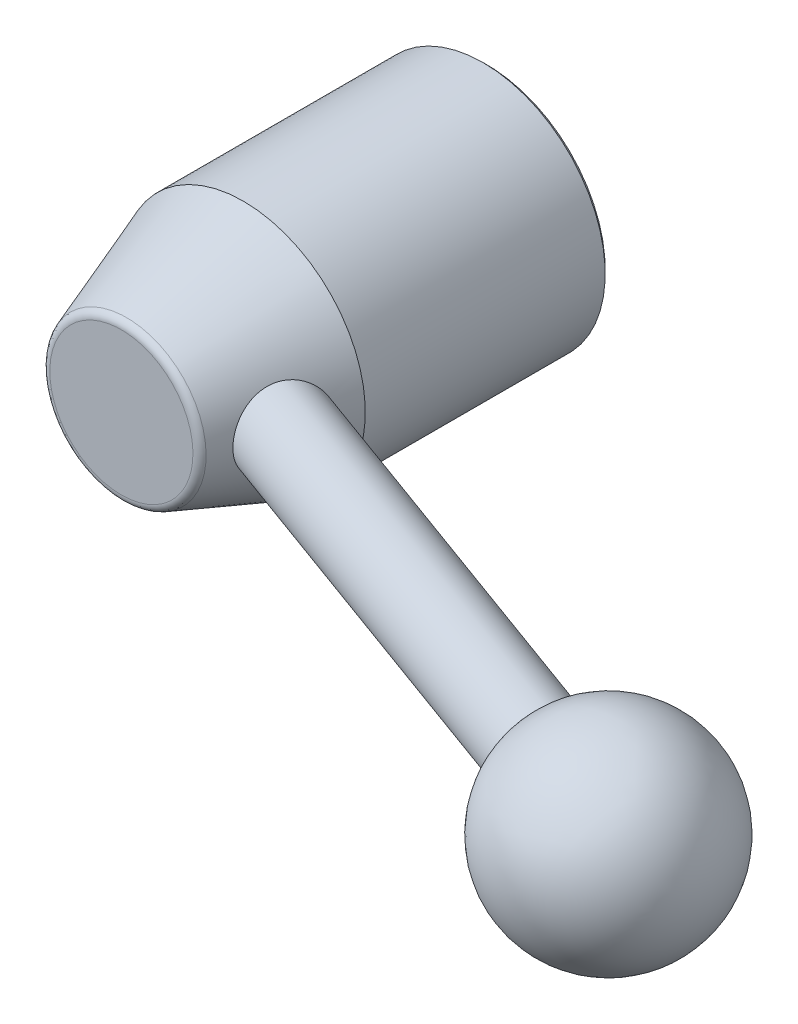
ISO-10303-21;
HEADER;
FILE_DESCRIPTION(('STEP AP214'),'2;1');
FILE_NAME('part.step','',(''),(''),'','','');
FILE_SCHEMA(('AUTOMOTIVE_DESIGN { 1 0 10303 214 1 1 1 1 }'));
ENDSEC;
DATA;
#1=APPLICATION_CONTEXT('core data for automotive mechanical design processes');
#2=APPLICATION_PROTOCOL_DEFINITION('international standard','automotive_design',2000,#1);
#3=PRODUCT_CONTEXT('',#1,'mechanical');
#4=PRODUCT('Part','Part','',(#3));
#5=PRODUCT_RELATED_PRODUCT_CATEGORY('part','',(#4));
#6=PRODUCT_DEFINITION_FORMATION('','',#4);
#7=PRODUCT_DEFINITION_CONTEXT('part definition',#1,'design');
#8=PRODUCT_DEFINITION('design','',#6,#7);
#9=PRODUCT_DEFINITION_SHAPE('','',#8);
#10=(LENGTH_UNIT() NAMED_UNIT(*) SI_UNIT(.MILLI.,.METRE.));
#11=(NAMED_UNIT(*) PLANE_ANGLE_UNIT() SI_UNIT($,.RADIAN.));
#12=(NAMED_UNIT(*) SI_UNIT($,.STERADIAN.) SOLID_ANGLE_UNIT());
#13=UNCERTAINTY_MEASURE_WITH_UNIT(LENGTH_MEASURE(1.E-05),#10,'distance_accuracy_value','');
#14=(GEOMETRIC_REPRESENTATION_CONTEXT(3) GLOBAL_UNCERTAINTY_ASSIGNED_CONTEXT((#13)) GLOBAL_UNIT_ASSIGNED_CONTEXT((#10,
#11,#12)) REPRESENTATION_CONTEXT('',''));
#15=CARTESIAN_POINT('',(0.,0.,0.));
#16=DIRECTION('',(0.,0.,1.));
#17=DIRECTION('',(1.,0.,0.));
#18=AXIS2_PLACEMENT_3D('',#15,#16,#17);
#19=CARTESIAN_POINT('',(0.,0.,44.3567262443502));
#20=DIRECTION('',(0.,0.,-1.));
#21=DIRECTION('',(0.,1.,0.));
#22=AXIS2_PLACEMENT_3D('',#19,#20,#21);
#23=CONICAL_SURFACE('',#22,9.77457898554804,0.349065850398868);
#24=CARTESIAN_POINT('',(0.,0.,44.3567262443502));
#25=DIRECTION('',(0.,0.,1.));
#26=DIRECTION('',(0.,-1.,0.));
#27=AXIS2_PLACEMENT_3D('',#24,#25,#26);
#28=CIRCLE('',#27,9.77457898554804);
#29=CARTESIAN_POINT('',(0.,-9.77457898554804,44.3567262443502));
#30=VERTEX_POINT('',#29);
#31=EDGE_CURVE('E38',#30,#30,#28,.T.);
#32=ORIENTED_EDGE('',*,*,#31,.F.);
#33=EDGE_LOOP('',(#32));
#34=FACE_BOUND('',#33,.T.);
#35=CARTESIAN_POINT('',(0.,0.,30.));
#36=DIRECTION('',(0.,0.,1.));
#37=DIRECTION('',(0.,-1.,0.));
#38=AXIS2_PLACEMENT_3D('',#35,#36,#37);
#39=CIRCLE('',#38,15.);
#40=CARTESIAN_POINT('',(0.,-15.,30.));
#41=VERTEX_POINT('',#40);
#42=EDGE_CURVE('E23',#41,#41,#39,.T.);
#43=ORIENTED_EDGE('',*,*,#42,.T.);
#44=EDGE_LOOP('',(#43));
#45=FACE_BOUND('',#44,.T.);
#46=CARTESIAN_POINT('',(13.4866161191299,-2.89578014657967,33.3134656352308));
#47=CARTESIAN_POINT('',(13.3849436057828,-3.12847751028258,33.452375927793));
#48=CARTESIAN_POINT('',(13.2731283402,-3.34645254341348,33.6084157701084));
#49=CARTESIAN_POINT('',(13.0355370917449,-3.74764614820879,33.9517038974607));
#50=CARTESIAN_POINT('',(12.9097604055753,-3.93086296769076,34.1389537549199));
#51=CARTESIAN_POINT('',(12.7160237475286,-4.17595402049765,34.4404563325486));
#52=CARTESIAN_POINT('',(12.6505448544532,-4.25274513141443,34.5444871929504));
#53=CARTESIAN_POINT('',(12.5187958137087,-4.39589711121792,34.7590016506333));
#54=CARTESIAN_POINT('',(12.4525259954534,-4.46226216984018,34.8694826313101));
#55=CARTESIAN_POINT('',(12.3201090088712,-4.58407191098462,35.096426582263));
#56=CARTESIAN_POINT('',(12.2539618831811,-4.63951331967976,35.212891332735));
#57=CARTESIAN_POINT('',(12.1227878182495,-4.73896035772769,35.4511449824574));
#58=CARTESIAN_POINT('',(12.0577603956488,-4.78297104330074,35.572931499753));
#59=CARTESIAN_POINT('',(11.9308448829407,-4.85850573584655,35.8190694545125));
#60=CARTESIAN_POINT('',(11.8689221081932,-4.89023059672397,35.943341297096));
#61=CARTESIAN_POINT('',(11.7479521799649,-4.94189925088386,36.1956151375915));
#62=CARTESIAN_POINT('',(11.6889037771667,-4.96184820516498,36.3236154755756));
#63=CARTESIAN_POINT('',(11.574487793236,-4.98973747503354,36.5825001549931));
#64=CARTESIAN_POINT('',(11.5191192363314,-4.99768098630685,36.713383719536));
#65=CARTESIAN_POINT('',(11.4127699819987,-5.00144266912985,36.9770915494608));
#66=CARTESIAN_POINT('',(11.3617890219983,-4.99726156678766,37.1099156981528));
#67=CARTESIAN_POINT('',(11.2679280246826,-4.97745127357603,37.3678410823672));
#68=CARTESIAN_POINT('',(11.2247376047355,-4.96257761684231,37.4928880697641));
#69=CARTESIAN_POINT('',(11.1430364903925,-4.92235520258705,37.7428747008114));
#70=CARTESIAN_POINT('',(11.1045273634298,-4.89700294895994,37.867814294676));
#71=CARTESIAN_POINT('',(11.0324205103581,-4.83607173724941,38.1165503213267));
#72=CARTESIAN_POINT('',(10.998820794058,-4.80049694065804,38.2403471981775));
#73=CARTESIAN_POINT('',(10.9365481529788,-4.71943295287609,38.485966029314));
#74=CARTESIAN_POINT('',(10.9078771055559,-4.67393999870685,38.6077872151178));
#75=CARTESIAN_POINT('',(10.8557317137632,-4.57412114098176,38.8468964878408));
#76=CARTESIAN_POINT('',(10.8321926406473,-4.51992231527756,38.9642235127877));
#77=CARTESIAN_POINT('',(10.7896018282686,-4.40270182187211,39.1952445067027));
#78=CARTESIAN_POINT('',(10.7705517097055,-4.33967698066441,39.3089371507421));
#79=CARTESIAN_POINT('',(10.7196912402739,-4.13803226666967,39.6433723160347));
#80=CARTESIAN_POINT('',(10.694138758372,-3.98677849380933,39.8576240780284));
#81=CARTESIAN_POINT('',(10.6551467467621,-3.64329486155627,40.2764763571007));
#82=CARTESIAN_POINT('',(10.6426426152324,-3.44898648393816,40.4794458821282));
#83=CARTESIAN_POINT('',(10.6280031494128,-3.03059054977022,40.8528588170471));
#84=CARTESIAN_POINT('',(10.625871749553,-2.80649172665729,41.0232898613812));
#85=CARTESIAN_POINT('',(10.6268403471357,-2.44683347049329,41.2530314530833));
#86=CARTESIAN_POINT('',(10.6279274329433,-2.32012745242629,41.3265282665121));
#87=CARTESIAN_POINT('',(10.6309754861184,-2.06078499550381,41.4621309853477));
#88=CARTESIAN_POINT('',(10.6329361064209,-1.92815093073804,41.5242414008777));
#89=CARTESIAN_POINT('',(10.637153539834,-1.65787870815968,41.636265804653));
#90=CARTESIAN_POINT('',(10.6394102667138,-1.52024201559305,41.6861833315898));
#91=CARTESIAN_POINT('',(10.6437285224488,-1.24095273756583,41.7731391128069));
#92=CARTESIAN_POINT('',(10.6457900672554,-1.09930048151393,41.8101784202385));
#93=CARTESIAN_POINT('',(10.6492299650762,-0.821629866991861,41.8690046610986));
#94=CARTESIAN_POINT('',(10.6506415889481,-0.685775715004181,41.8915659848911));
#95=CARTESIAN_POINT('',(10.6527396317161,-0.412591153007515,41.9244545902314));
#96=CARTESIAN_POINT('',(10.6534260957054,-0.275260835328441,41.9347826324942));
#97=CARTESIAN_POINT('',(10.6539733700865,-0.00026386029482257,41.9430469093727));
#98=CARTESIAN_POINT('',(10.6538344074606,0.137402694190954,41.9409865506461));
#99=CARTESIAN_POINT('',(10.6527516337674,0.411986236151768,41.9245149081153));
#100=CARTESIAN_POINT('',(10.6518078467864,0.548903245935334,41.9101039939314));
#101=CARTESIAN_POINT('',(10.6493319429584,0.812615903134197,41.8703945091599));
#102=CARTESIAN_POINT('',(10.6478391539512,0.939520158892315,41.8458124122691));
#103=CARTESIAN_POINT('',(10.6444739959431,1.19087626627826,41.7862688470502));
#104=CARTESIAN_POINT('',(10.6426015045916,1.31532731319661,41.7513040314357));
#105=CARTESIAN_POINT('',(10.6368167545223,1.68374091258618,41.6314333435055));
#106=CARTESIAN_POINT('',(10.6327344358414,1.92297521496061,41.5315186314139));
#107=CARTESIAN_POINT('',(10.626963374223,2.39175825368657,41.291438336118));
#108=CARTESIAN_POINT('',(10.6253720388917,2.62058773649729,41.1498807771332));
#109=CARTESIAN_POINT('',(10.6289117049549,3.05388892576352,40.8334190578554));
#110=CARTESIAN_POINT('',(10.6340459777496,3.25834872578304,40.6584987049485));
#111=CARTESIAN_POINT('',(10.6562265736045,3.653661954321,40.2658022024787));
#112=CARTESIAN_POINT('',(10.6741642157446,3.84223703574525,40.04575680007));
#113=CARTESIAN_POINT('',(10.7145045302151,4.0965027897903,39.6967404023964));
#114=CARTESIAN_POINT('',(10.7302023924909,4.17652738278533,39.5771738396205));
#115=CARTESIAN_POINT('',(10.7666163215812,4.32647095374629,39.3326134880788));
#116=CARTESIAN_POINT('',(10.7873301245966,4.39639446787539,39.2076221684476));
#117=CARTESIAN_POINT('',(10.834091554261,4.52520304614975,38.9538685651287));
#118=CARTESIAN_POINT('',(10.8601111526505,4.58414312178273,38.8251290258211));
#119=CARTESIAN_POINT('',(10.9178171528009,4.69084784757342,38.564388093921));
#120=CARTESIAN_POINT('',(10.9495010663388,4.73861738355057,38.4323881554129));
#121=CARTESIAN_POINT('',(11.018634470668,4.82250113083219,38.1662533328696));
#122=CARTESIAN_POINT('',(11.056082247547,4.85861879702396,38.0321190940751));
#123=CARTESIAN_POINT('',(11.1366501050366,4.91882283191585,37.7628604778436));
#124=CARTESIAN_POINT('',(11.1797697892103,4.9429100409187,37.6277361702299));
#125=CARTESIAN_POINT('',(11.2679683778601,4.97746416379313,37.3677152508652));
#126=CARTESIAN_POINT('',(11.3126638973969,4.98880982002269,37.2428044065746));
#127=CARTESIAN_POINT('',(11.4062760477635,5.0008865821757,36.994006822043));
#128=CARTESIAN_POINT('',(11.4551940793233,5.0016141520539,36.8701204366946));
#129=CARTESIAN_POINT('',(11.5567050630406,4.99246836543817,36.6243144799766));
#130=CARTESIAN_POINT('',(11.6092967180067,4.98259873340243,36.5023942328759));
#131=CARTESIAN_POINT('',(11.7175793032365,4.95238582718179,36.2612075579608));
#132=CARTESIAN_POINT('',(11.773271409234,4.93203855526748,36.1419421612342));
#133=CARTESIAN_POINT('',(11.8863361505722,4.88140229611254,35.9082977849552));
#134=CARTESIAN_POINT('',(11.9436783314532,4.85124328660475,35.7938759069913));
#135=CARTESIAN_POINT('',(12.0600189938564,4.78119486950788,35.5689017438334));
#136=CARTESIAN_POINT('',(12.1190180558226,4.74130201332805,35.4583508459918));
#137=CARTESIAN_POINT('',(12.29741104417,4.60748596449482,35.133339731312));
#138=CARTESIAN_POINT('',(12.4182869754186,4.49938677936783,34.9253456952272));
#139=CARTESIAN_POINT('',(12.6652215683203,4.24094380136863,34.5186274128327));
#140=CARTESIAN_POINT('',(12.7911593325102,4.08846488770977,34.3211960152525));
#141=CARTESIAN_POINT('',(13.0344108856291,3.74830628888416,33.9530395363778));
#142=CARTESIAN_POINT('',(13.1517221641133,3.56061641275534,33.7823222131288));
#143=CARTESIAN_POINT('',(13.3762612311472,3.14577163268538,33.4639961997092));
#144=CARTESIAN_POINT('',(13.482852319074,2.91728287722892,33.3176709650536));
#145=CARTESIAN_POINT('',(13.6737089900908,2.43262308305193,33.0605505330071));
#146=CARTESIAN_POINT('',(13.7579774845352,2.17645566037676,32.9497507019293));
#147=CARTESIAN_POINT('',(13.897342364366,1.6493155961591,32.7686038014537));
#148=CARTESIAN_POINT('',(13.9530318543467,1.37878460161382,32.6974314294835));
#149=CARTESIAN_POINT('',(14.0343080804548,0.826036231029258,32.5940654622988));
#150=CARTESIAN_POINT('',(14.0599059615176,0.54382322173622,32.5618574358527));
#151=CARTESIAN_POINT('',(14.0788321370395,-0.010090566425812,32.5380198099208));
#152=CARTESIAN_POINT('',(14.0736151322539,-0.28166491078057,32.5445609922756));
#153=CARTESIAN_POINT('',(14.0346275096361,-0.819441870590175,32.5937667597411));
#154=CARTESIAN_POINT('',(14.000853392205,-1.0856438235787,32.6364357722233));
#155=CARTESIAN_POINT('',(13.9034111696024,-1.62386117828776,32.7609942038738));
#156=CARTESIAN_POINT('',(13.8377685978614,-1.89491881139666,32.8454825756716));
#157=CARTESIAN_POINT('',(13.6803642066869,-2.41418729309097,33.0520484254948));
#158=CARTESIAN_POINT('',(13.5885918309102,-2.66238885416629,33.1741410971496));
#159=CARTESIAN_POINT('',(13.4866161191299,-2.89578014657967,33.3134656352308));
#160=B_SPLINE_CURVE_WITH_KNOTS('',3,(#46,#47,#48,#49,#50,#51,#52,#53,#54,#55,#56,#57,#58,#59,
#60,#61,#62,#63,#64,#65,#66,#67,#68,#69,#70,#71,#72,#73,#74,#75,#76,#77,#78,#79,#80,#81,#82,#83,
#84,#85,#86,#87,#88,#89,#90,#91,#92,#93,#94,#95,#96,#97,#98,#99,#100,#101,#102,#103,#104,#105,
#106,#107,#108,#109,#110,#111,#112,#113,#114,#115,#116,#117,#118,#119,#120,#121,#122,#123,#124,
#125,#126,#127,#128,#129,#130,#131,#132,#133,#134,#135,#136,#137,#138,#139,#140,#141,#142,#143,
#144,#145,#146,#147,#148,#149,#150,#151,#152,#153,#154,#155,#156,#157,#158,#159),.UNSPECIFIED.,
.T.,.F.,(4,2,2,2,2,2,2,2,2,2,2,2,2,2,2,2,2,2,2,2,2,2,2,2,2,2,2,2,2,2,2,2,2,2,2,2,2,2,2,2,2,2,2,
2,2,2,2,2,2,2,2,2,2,2,2,2,4),(0.,0.867330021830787,1.73470375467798,2.16909025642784,
2.60330174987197,3.03764317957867,3.47179215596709,3.89850924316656,4.3250391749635,
4.75145555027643,5.17784638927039,5.57674433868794,5.97577548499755,6.37464441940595,
6.77366495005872,7.16731687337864,7.5611107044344,8.34820033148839,9.18848679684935,
10.0290919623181,10.4680735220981,10.9068808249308,11.3455606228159,11.7842045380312,
12.1968298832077,12.6094295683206,13.0219157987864,13.4343896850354,13.821744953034,
14.2092252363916,14.9835520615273,15.7874627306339,16.5917645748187,17.458325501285,
17.8920748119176,18.325628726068,18.7569490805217,19.1880804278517,19.6190838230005,
20.050057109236,20.4490207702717,20.8481172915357,21.2470735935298,21.646182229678,
22.0402055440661,22.4343686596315,23.2221041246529,24.056824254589,24.8917863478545,
25.7620783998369,26.6322568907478,27.4835609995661,28.3345497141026,29.1456965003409,
29.9569427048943,30.8265073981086,31.6964238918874),.UNSPECIFIED.);
#161=CARTESIAN_POINT('',(13.4866161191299,-2.89578014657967,33.3134656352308));
#162=VERTEX_POINT('',#161);
#163=EDGE_CURVE('E47',#162,#162,#160,.T.);
#164=ORIENTED_EDGE('',*,*,#163,.T.);
#165=EDGE_LOOP('',(#164));
#166=FACE_BOUND('',#165,.T.);
#167=ADVANCED_FACE('F12',(#34,#45,#166),#23,.T.);
#168=CARTESIAN_POINT('',(0.,0.,51.6088793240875));
#169=DIRECTION('',(0.,0.,1.));
#170=DIRECTION('',(0.,-1.,0.));
#171=AXIS2_PLACEMENT_3D('',#168,#169,#170);
#172=CYLINDRICAL_SURFACE('',#171,15.);
#173=CARTESIAN_POINT('',(0.,0.,0.5));
#174=DIRECTION('',(0.,0.,1.));
#175=DIRECTION('',(0.,-1.,0.));
#176=AXIS2_PLACEMENT_3D('',#173,#174,#175);
#177=CIRCLE('',#176,15.);
#178=CARTESIAN_POINT('',(0.,-15.,0.5));
#179=VERTEX_POINT('',#178);
#180=EDGE_CURVE('E27',#179,#179,#177,.T.);
#181=ORIENTED_EDGE('',*,*,#180,.T.);
#182=EDGE_LOOP('',(#181));
#183=FACE_BOUND('',#182,.T.);
#184=ORIENTED_EDGE('',*,*,#42,.F.);
#185=EDGE_LOOP('',(#184));
#186=FACE_BOUND('',#185,.T.);
#187=ADVANCED_FACE('F85',(#183,#186),#172,.T.);
#188=CARTESIAN_POINT('',(0.,0.,0.5));
#189=DIRECTION('',(0.,0.,1.));
#190=DIRECTION('',(0.,-1.,0.));
#191=AXIS2_PLACEMENT_3D('',#188,#189,#190);
#192=CONICAL_SURFACE('',#191,15.,0.785398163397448);
#193=CARTESIAN_POINT('',(0.,0.,0.));
#194=DIRECTION('',(0.,0.,1.));
#195=DIRECTION('',(0.,-1.,0.));
#196=AXIS2_PLACEMENT_3D('',#193,#194,#195);
#197=CIRCLE('',#196,14.5);
#198=CARTESIAN_POINT('',(0.,-14.5,0.));
#199=VERTEX_POINT('',#198);
#200=EDGE_CURVE('E32',#199,#199,#197,.T.);
#201=ORIENTED_EDGE('',*,*,#200,.T.);
#202=EDGE_LOOP('',(#201));
#203=FACE_BOUND('',#202,.T.);
#204=ORIENTED_EDGE('',*,*,#180,.F.);
#205=EDGE_LOOP('',(#204));
#206=FACE_BOUND('',#205,.T.);
#207=ADVANCED_FACE('F83',(#203,#206),#192,.T.);
#208=CARTESIAN_POINT('',(-14.5,0.,0.));
#209=DIRECTION('',(0.,0.,-1.));
#210=DIRECTION('',(0.,1.,0.));
#211=AXIS2_PLACEMENT_3D('',#208,#209,#210);
#212=PLANE('',#211);
#213=CARTESIAN_POINT('',(0.,0.,0.));
#214=DIRECTION('',(0.,0.,-1.));
#215=DIRECTION('',(-1.,0.,0.));
#216=AXIS2_PLACEMENT_3D('',#213,#214,#215);
#217=CIRCLE('',#216,6.5);
#218=CARTESIAN_POINT('',(-6.5,0.,0.));
#219=VERTEX_POINT('',#218);
#220=EDGE_CURVE('E8',#219,#219,#217,.F.);
#221=ORIENTED_EDGE('',*,*,#220,.T.);
#222=EDGE_LOOP('',(#221));
#223=FACE_BOUND('',#222,.T.);
#224=ORIENTED_EDGE('',*,*,#200,.F.);
#225=EDGE_LOOP('',(#224));
#226=FACE_BOUND('',#225,.T.);
#227=ADVANCED_FACE('F79',(#223,#226),#212,.T.);
#228=CARTESIAN_POINT('',(0.,0.,45.));
#229=DIRECTION('',(0.,0.,1.));
#230=DIRECTION('',(0.,-1.,0.));
#231=AXIS2_PLACEMENT_3D('',#228,#229,#230);
#232=PLANE('',#231);
#233=CARTESIAN_POINT('',(0.,0.,45.));
#234=DIRECTION('',(0.,0.,1.));
#235=DIRECTION('',(0.,-1.,0.));
#236=AXIS2_PLACEMENT_3D('',#233,#234,#235);
#237=CIRCLE('',#236,8.80156364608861);
#238=CARTESIAN_POINT('',(0.,-8.80156364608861,45.));
#239=VERTEX_POINT('',#238);
#240=EDGE_CURVE('E35',#239,#239,#237,.T.);
#241=ORIENTED_EDGE('',*,*,#240,.T.);
#242=EDGE_LOOP('',(#241));
#243=FACE_BOUND('',#242,.T.);
#244=ADVANCED_FACE('F75',(#243),#232,.T.);
#245=CARTESIAN_POINT('',(0.,0.,44.0007422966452));
#246=DIRECTION('',(0.,0.,1.));
#247=DIRECTION('',(0.,-1.,0.));
#248=AXIS2_PLACEMENT_3D('',#245,#246,#247);
#249=TOROIDAL_SURFACE('',#248,8.84008691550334,1.);
#250=ORIENTED_EDGE('',*,*,#31,.T.);
#251=EDGE_LOOP('',(#250));
#252=FACE_BOUND('',#251,.T.);
#253=ORIENTED_EDGE('',*,*,#240,.F.);
#254=EDGE_LOOP('',(#253));
#255=FACE_BOUND('',#254,.T.);
#256=ADVANCED_FACE('F64',(#252,#255),#249,.T.);
#257=CARTESIAN_POINT('',(0.,0.,22.));
#258=DIRECTION('',(0.,0.,-1.));
#259=DIRECTION('',(-1.,0.,0.));
#260=AXIS2_PLACEMENT_3D('',#257,#258,#259);
#261=CYLINDRICAL_SURFACE('',#260,6.);
#262=CARTESIAN_POINT('',(0.,0.,0.500000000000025));
#263=DIRECTION('',(0.,0.,-1.));
#264=DIRECTION('',(-1.,0.,0.));
#265=AXIS2_PLACEMENT_3D('',#262,#263,#264);
#266=CIRCLE('',#265,6.);
#267=CARTESIAN_POINT('',(-6.,0.,0.500000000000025));
#268=VERTEX_POINT('',#267);
#269=EDGE_CURVE('E19',#268,#268,#266,.T.);
#270=ORIENTED_EDGE('',*,*,#269,.T.);
#271=EDGE_LOOP('',(#270));
#272=FACE_BOUND('',#271,.T.);
#273=CARTESIAN_POINT('',(0.,0.,22.));
#274=DIRECTION('',(0.,0.,-1.));
#275=DIRECTION('',(-1.,0.,0.));
#276=AXIS2_PLACEMENT_3D('',#273,#274,#275);
#277=CIRCLE('',#276,6.);
#278=CARTESIAN_POINT('',(-6.,0.,22.));
#279=VERTEX_POINT('',#278);
#280=EDGE_CURVE('E44',#279,#279,#277,.T.);
#281=ORIENTED_EDGE('',*,*,#280,.F.);
#282=EDGE_LOOP('',(#281));
#283=FACE_BOUND('',#282,.T.);
#284=ADVANCED_FACE('F60',(#272,#283),#261,.F.);
#285=CARTESIAN_POINT('',(0.,0.,22.));
#286=DIRECTION('',(0.,0.,-1.));
#287=DIRECTION('',(-1.,0.,0.));
#288=AXIS2_PLACEMENT_3D('',#285,#286,#287);
#289=PLANE('',#288);
#290=ORIENTED_EDGE('',*,*,#280,.T.);
#291=EDGE_LOOP('',(#290));
#292=FACE_BOUND('',#291,.T.);
#293=ADVANCED_FACE('F57',(#292),#289,.T.);
#294=CARTESIAN_POINT('',(0.,0.,0.500000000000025));
#295=DIRECTION('',(0.,0.,-1.));
#296=DIRECTION('',(-1.,0.,0.));
#297=AXIS2_PLACEMENT_3D('',#294,#295,#296);
#298=CONICAL_SURFACE('',#297,6.,0.785398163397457);
#299=ORIENTED_EDGE('',*,*,#220,.F.);
#300=EDGE_LOOP('',(#299));
#301=FACE_BOUND('',#300,.T.);
#302=ORIENTED_EDGE('',*,*,#269,.F.);
#303=EDGE_LOOP('',(#302));
#304=FACE_BOUND('',#303,.T.);
#305=ADVANCED_FACE('F14',(#301,#304),#298,.F.);
#306=CARTESIAN_POINT('',(74.889595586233,0.,60.));
#307=DIRECTION('',(0.,-1.,0.));
#308=DIRECTION('',(1.,0.,0.));
#309=AXIS2_PLACEMENT_3D('',#306,#307,#308);
#310=SPHERICAL_SURFACE('',#309,12.5);
#311=CARTESIAN_POINT('',(74.889595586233,0.,60.));
#312=DIRECTION('',(0.939692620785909,0.,0.342020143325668));
#313=DIRECTION('',(-0.342020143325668,0.,0.939692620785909));
#314=AXIS2_PLACEMENT_3D('',#311,#312,#313);
#315=SPHERICAL_SURFACE('',#314,12.5);
#316=CARTESIAN_POINT('',(64.124064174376,0.,56.081667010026));
#317=DIRECTION('',(0.939692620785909,0.,0.342020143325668));
#318=DIRECTION('',(-0.342020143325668,0.,0.939692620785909));
#319=AXIS2_PLACEMENT_3D('',#316,#317,#318);
#320=CIRCLE('',#319,5.00000000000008);
#321=CARTESIAN_POINT('',(62.4139634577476,0.,60.7801301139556));
#322=VERTEX_POINT('',#321);
#323=EDGE_CURVE('E41',#322,#322,#320,.T.);
#324=ORIENTED_EDGE('',*,*,#323,.T.);
#325=EDGE_LOOP('',(#324));
#326=FACE_BOUND('',#325,.T.);
#327=ADVANCED_FACE('F68',(#326),#315,.T.);
#328=CARTESIAN_POINT('',(96.257775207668,0.,67.777381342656));
#329=DIRECTION('',(0.939692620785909,0.,0.342020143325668));
#330=DIRECTION('',(-0.342020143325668,0.,0.939692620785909));
#331=AXIS2_PLACEMENT_3D('',#328,#329,#330);
#332=CYLINDRICAL_SURFACE('',#331,5.);
#333=ORIENTED_EDGE('',*,*,#163,.F.);
#334=EDGE_LOOP('',(#333));
#335=FACE_BOUND('',#334,.T.);
#336=ORIENTED_EDGE('',*,*,#323,.F.);
#337=EDGE_LOOP('',(#336));
#338=FACE_BOUND('',#337,.T.);
#339=ADVANCED_FACE('F65',(#335,#338),#332,.T.);
#340=CLOSED_SHELL('',(#167,#187,#207,#227,#244,#256,#284,#293,#305,#327,#339));
#341=MANIFOLD_SOLID_BREP('B1',#340);
#342=ADVANCED_BREP_SHAPE_REPRESENTATION('',(#18,#341),#14);
#343=SHAPE_DEFINITION_REPRESENTATION(#9,#342);
ENDSEC;
END-ISO-10303-21;
